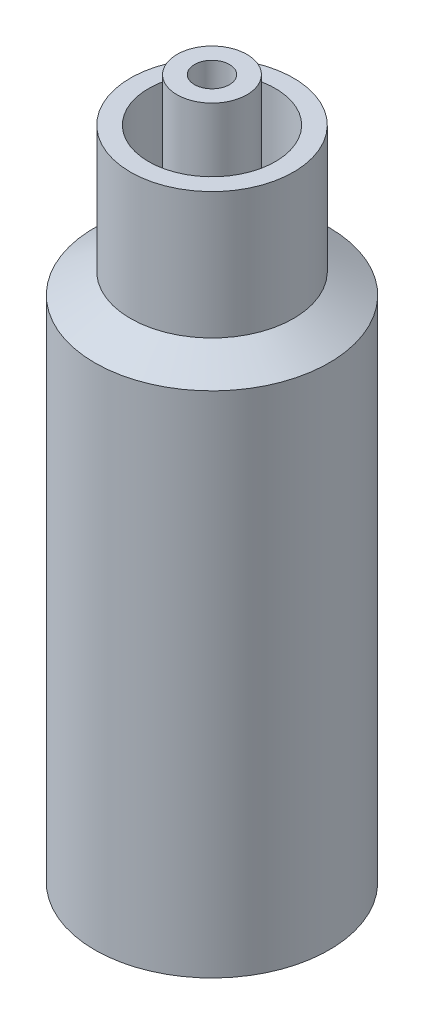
from build123d import *


with BuildPart() as part:
    # Sketch1 → Revolve1 (revolve)
    with BuildSketch(Plane.XY, mode=Mode.PRIVATE) as revolve1_sk:
        Polygon((-5.7912, 0), (-6.8072, 0), (-6.8072, 29.538827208), (-4.7371, 30.734), (-4.7371, 38.1), (-3.683, 38.1), (-3.683, 31.342584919), (-2.032, 32.295790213), (-2.032, 40.64), (-1.016, 40.64), (-1.016, 31.70920234), (-5.7912, 28.952239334), align=None)
    revolve(revolve1_sk.sketch.rotate(Axis((0, 0, 0), (0, -1, 0)), 270), axis=Axis((0, 0, 0), (0, -1, 0)))


with BuildPart() as body_2:
    # Sketch2 → Revolve2 (revolve)
    with BuildSketch(Plane.XY, mode=Mode.PRIVATE) as revolve2_sk:
        Polygon((0, 12.240089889), (-5.715, 10.16), (-5.715, 6.35), (0, 6.35), align=None)
    revolve(revolve2_sk.sketch.rotate(Axis((0, 0, 0), (0, 1, 0)), 180), axis=Axis((0, 0, 0), (0, 1, 0)))


solid = Compound([part.part, body_2.part])
